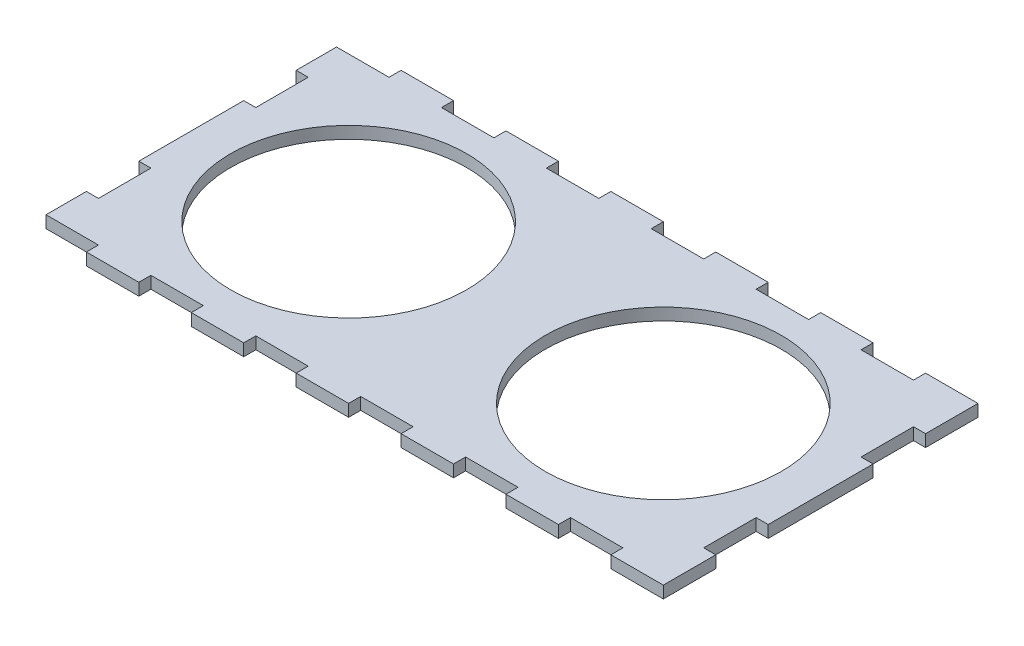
from build123d import *

# Parameters (mm, degrees)
SKETCH1_R           = 57.15
BOSS_EXTRUDE1_DEPTH = 5.842


with BuildPart() as part:
    # Sketch1 → Boss-Extrude1 (new body)
    with BuildSketch(Plane(origin=(0, 0, 0), x_dir=(1, 0, 0), z_dir=(0, 1, 0))):
        Polygon((-228.6, 70.358), (-203.2, 70.358), (-203.2, 76.2), (-177.8, 76.2), (-177.8, 70.358), (-152.4, 70.358), (-152.4, 76.2), (-127, 76.2), (-127, 70.358), (-101.6, 70.358), (-101.6, 76.2), (-76.2, 76.2), (-76.2, 70.358), (-50.8, 70.358), (-50.8, 76.2), (-25.4, 76.2), (-25.4, 70.358), (0, 70.358), (0, 76.2), (25.4, 76.2), (25.4, 70.358), (50.8, 70.358), (50.8, 76.2), (76.2, 76.2), (76.2, 50.8), (70.358, 50.8), (70.358, 25.4), (76.2, 25.4), (76.2, -25.4), (70.358, -25.4), (70.358, -50.8), (76.2, -50.8), (76.2, -76.2), (50.8, -76.2), (50.8, -70.358), (25.4, -70.358), (25.4, -76.2), (0, -76.2), (0, -70.358), (-25.4, -70.358), (-25.4, -76.2), (-50.8, -76.2), (-50.8, -70.358), (-76.2, -70.358), (-76.2, -76.2), (-101.6, -76.2), (-101.6, -70.358), (-127, -70.358), (-127, -76.2), (-152.4, -76.2), (-152.4, -70.358), (-177.8, -70.358), (-177.8, -76.2), (-203.2, -76.2), (-203.2, -70.358), (-228.6, -70.358), (-228.6, -50.8), (-222.758, -50.8), (-222.758, -25.4), (-228.6, -25.4), (-228.6, 25.4), (-222.758, 25.4), (-222.758, 50.8), (-228.6, 50.8), align=None)
        with Locations(Location((0, 0, 0), (0, 0, 270))):
            Circle(SKETCH1_R, mode=Mode.SUBTRACT)
        with Locations(Location((-152.4, 0, 0), (0, 0, 270))):
            Circle(SKETCH1_R, mode=Mode.SUBTRACT)
    extrude(amount=BOSS_EXTRUDE1_DEPTH)


solid = part.part
